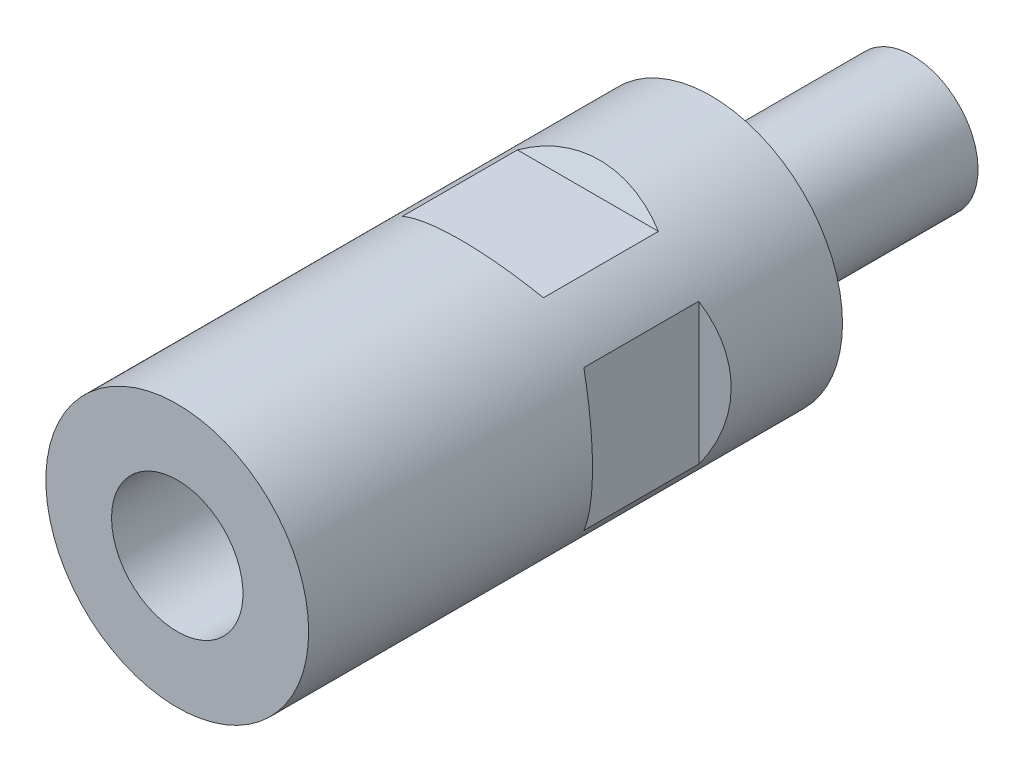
ISO-10303-21;
HEADER;
FILE_DESCRIPTION(('STEP AP214'),'2;1');
FILE_NAME('part.step','',(''),(''),'','','');
FILE_SCHEMA(('AUTOMOTIVE_DESIGN { 1 0 10303 214 1 1 1 1 }'));
ENDSEC;
DATA;
#1=APPLICATION_CONTEXT('core data for automotive mechanical design processes');
#2=APPLICATION_PROTOCOL_DEFINITION('international standard','automotive_design',2000,#1);
#3=PRODUCT_CONTEXT('',#1,'mechanical');
#4=PRODUCT('Part','Part','',(#3));
#5=PRODUCT_RELATED_PRODUCT_CATEGORY('part','',(#4));
#6=PRODUCT_DEFINITION_FORMATION('','',#4);
#7=PRODUCT_DEFINITION_CONTEXT('part definition',#1,'design');
#8=PRODUCT_DEFINITION('design','',#6,#7);
#9=PRODUCT_DEFINITION_SHAPE('','',#8);
#10=(LENGTH_UNIT() NAMED_UNIT(*) SI_UNIT(.MILLI.,.METRE.));
#11=(NAMED_UNIT(*) PLANE_ANGLE_UNIT() SI_UNIT($,.RADIAN.));
#12=(NAMED_UNIT(*) SI_UNIT($,.STERADIAN.) SOLID_ANGLE_UNIT());
#13=UNCERTAINTY_MEASURE_WITH_UNIT(LENGTH_MEASURE(1.E-05),#10,'distance_accuracy_value','');
#14=(GEOMETRIC_REPRESENTATION_CONTEXT(3) GLOBAL_UNCERTAINTY_ASSIGNED_CONTEXT((#13)) GLOBAL_UNIT_ASSIGNED_CONTEXT((#10,
#11,#12)) REPRESENTATION_CONTEXT('',''));
#15=CARTESIAN_POINT('',(0.,0.,0.));
#16=DIRECTION('',(0.,0.,1.));
#17=DIRECTION('',(1.,0.,0.));
#18=AXIS2_PLACEMENT_3D('',#15,#16,#17);
#19=CARTESIAN_POINT('',(0.,0.,-24.5));
#20=DIRECTION('',(0.,0.,1.));
#21=DIRECTION('',(0.,-1.,0.));
#22=AXIS2_PLACEMENT_3D('',#19,#20,#21);
#23=PLANE('',#22);
#24=CARTESIAN_POINT('',(0.,0.,-24.5));
#25=DIRECTION('',(0.,0.,1.));
#26=DIRECTION('',(0.,-1.,0.));
#27=AXIS2_PLACEMENT_3D('',#24,#25,#26);
#28=CIRCLE('',#27,8.);
#29=CARTESIAN_POINT('',(0.,-8.,-24.5));
#30=VERTEX_POINT('',#29);
#31=EDGE_CURVE('E17',#30,#30,#28,.F.);
#32=ORIENTED_EDGE('',*,*,#31,.T.);
#33=EDGE_LOOP('',(#32));
#34=FACE_BOUND('',#33,.T.);
#35=ADVANCED_FACE('F14',(#34),#23,.F.);
#36=CARTESIAN_POINT('',(0.,0.,-4.5));
#37=DIRECTION('',(0.,0.,1.));
#38=DIRECTION('',(0.,-1.,0.));
#39=AXIS2_PLACEMENT_3D('',#36,#37,#38);
#40=CYLINDRICAL_SURFACE('',#39,8.);
#41=CARTESIAN_POINT('',(0.,0.,0.));
#42=DIRECTION('',(0.,0.,-1.));
#43=DIRECTION('',(-1.,0.,0.));
#44=AXIS2_PLACEMENT_3D('',#41,#42,#43);
#45=CIRCLE('',#44,8.);
#46=CARTESIAN_POINT('',(-8.,0.,0.));
#47=VERTEX_POINT('',#46);
#48=EDGE_CURVE('E9',#47,#47,#45,.T.);
#49=ORIENTED_EDGE('',*,*,#48,.T.);
#50=EDGE_LOOP('',(#49));
#51=FACE_BOUND('',#50,.T.);
#52=ORIENTED_EDGE('',*,*,#31,.F.);
#53=EDGE_LOOP('',(#52));
#54=FACE_BOUND('',#53,.T.);
#55=ADVANCED_FACE('F175',(#51,#54),#40,.T.);
#56=CARTESIAN_POINT('',(13.5,-16.,29.));
#57=DIRECTION('',(-0.5,0.,0.86602540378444));
#58=DIRECTION('',(0.86602540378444,0.,0.5));
#59=AXIS2_PLACEMENT_3D('',#56,#57,#58);
#60=PLANE('',#59);
#61=DIRECTION('',(0.,1.,0.));
#62=VECTOR('',#61,1.);
#63=CARTESIAN_POINT('',(13.5,-16.,29.));
#64=LINE('',#63,#62);
#65=CARTESIAN_POINT('',(13.5,-8.58778201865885,29.));
#66=VERTEX_POINT('',#65);
#67=CARTESIAN_POINT('',(13.5,8.58778201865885,29.));
#68=VERTEX_POINT('',#67);
#69=EDGE_CURVE('E139',#66,#68,#64,.T.);
#70=ORIENTED_EDGE('',*,*,#69,.T.);
#71=CARTESIAN_POINT('',(0.,0.,21.2057713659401));
#72=DIRECTION('',(-0.5,0.,0.86602540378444));
#73=DIRECTION('',(-0.86602540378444,0.,-0.5));
#74=AXIS2_PLACEMENT_3D('',#71,#72,#73);
#75=ELLIPSE('',#74,18.475208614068,16.);
#76=EDGE_CURVE('E35',#66,#68,#75,.T.);
#77=ORIENTED_EDGE('',*,*,#76,.F.);
#78=EDGE_LOOP('',(#70,#77));
#79=FACE_BOUND('',#78,.T.);
#80=ADVANCED_FACE('F183',(#79),#60,.F.);
#81=CARTESIAN_POINT('',(13.5,-16.,29.));
#82=DIRECTION('',(-1.,0.,0.));
#83=DIRECTION('',(0.,0.,1.));
#84=AXIS2_PLACEMENT_3D('',#81,#82,#83);
#85=PLANE('',#84);
#86=ORIENTED_EDGE('',*,*,#69,.F.);
#87=DIRECTION('',(0.,0.,-1.));
#88=VECTOR('',#87,1.);
#89=CARTESIAN_POINT('',(13.5,-8.58778201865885,65.));
#90=LINE('',#89,#88);
#91=CARTESIAN_POINT('',(13.5,-8.58778201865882,15.));
#92=VERTEX_POINT('',#91);
#93=EDGE_CURVE('E126',#92,#66,#90,.F.);
#94=ORIENTED_EDGE('',*,*,#93,.F.);
#95=DIRECTION('',(0.,1.,0.));
#96=VECTOR('',#95,1.);
#97=CARTESIAN_POINT('',(13.5,-16.,15.));
#98=LINE('',#97,#96);
#99=CARTESIAN_POINT('',(13.5,8.58778201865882,15.));
#100=VERTEX_POINT('',#99);
#101=EDGE_CURVE('E140',#92,#100,#98,.T.);
#102=ORIENTED_EDGE('',*,*,#101,.T.);
#103=DIRECTION('',(0.,0.,-1.));
#104=VECTOR('',#103,1.);
#105=CARTESIAN_POINT('',(13.5,8.58778201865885,65.));
#106=LINE('',#105,#104);
#107=EDGE_CURVE('E29',#68,#100,#106,.T.);
#108=ORIENTED_EDGE('',*,*,#107,.F.);
#109=EDGE_LOOP('',(#86,#94,#102,#108));
#110=FACE_BOUND('',#109,.T.);
#111=ADVANCED_FACE('F212',(#110),#85,.F.);
#112=CARTESIAN_POINT('',(13.5,-16.,15.));
#113=DIRECTION('',(-0.5,0.,-0.866025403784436));
#114=DIRECTION('',(-0.866025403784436,0.,0.5));
#115=AXIS2_PLACEMENT_3D('',#112,#113,#114);
#116=PLANE('',#115);
#117=CARTESIAN_POINT('',(0.,0.,22.7942286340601));
#118=DIRECTION('',(-0.5,0.,-0.866025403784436));
#119=DIRECTION('',(0.866025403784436,0.,-0.5));
#120=AXIS2_PLACEMENT_3D('',#117,#118,#119);
#121=ELLIPSE('',#120,18.4752086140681,16.);
#122=EDGE_CURVE('E131',#100,#92,#121,.T.);
#123=ORIENTED_EDGE('',*,*,#122,.F.);
#124=ORIENTED_EDGE('',*,*,#101,.F.);
#125=EDGE_LOOP('',(#123,#124));
#126=FACE_BOUND('',#125,.T.);
#127=ADVANCED_FACE('F220',(#126),#116,.F.);
#128=CARTESIAN_POINT('',(-13.5,-16.,15.));
#129=DIRECTION('',(0.5,0.,-0.866025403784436));
#130=DIRECTION('',(-0.866025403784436,0.,-0.5));
#131=AXIS2_PLACEMENT_3D('',#128,#129,#130);
#132=PLANE('',#131);
#133=CARTESIAN_POINT('',(0.,0.,22.7942286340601));
#134=DIRECTION('',(0.5,0.,-0.866025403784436));
#135=DIRECTION('',(-0.866025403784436,0.,-0.5));
#136=AXIS2_PLACEMENT_3D('',#133,#134,#135);
#137=ELLIPSE('',#136,18.4752086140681,16.);
#138=CARTESIAN_POINT('',(-13.5,-8.58778201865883,15.));
#139=VERTEX_POINT('',#138);
#140=CARTESIAN_POINT('',(-13.5,8.58778201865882,15.));
#141=VERTEX_POINT('',#140);
#142=EDGE_CURVE('E124',#139,#141,#137,.T.);
#143=ORIENTED_EDGE('',*,*,#142,.F.);
#144=DIRECTION('',(0.,1.,0.));
#145=VECTOR('',#144,1.);
#146=CARTESIAN_POINT('',(-13.5,-16.,15.));
#147=LINE('',#146,#145);
#148=EDGE_CURVE('E144',#139,#141,#147,.T.);
#149=ORIENTED_EDGE('',*,*,#148,.T.);
#150=EDGE_LOOP('',(#143,#149));
#151=FACE_BOUND('',#150,.T.);
#152=ADVANCED_FACE('F228',(#151),#132,.F.);
#153=CARTESIAN_POINT('',(-13.5,-16.,29.));
#154=DIRECTION('',(0.5,0.,0.86602540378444));
#155=DIRECTION('',(0.86602540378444,0.,-0.5));
#156=AXIS2_PLACEMENT_3D('',#153,#154,#155);
#157=PLANE('',#156);
#158=DIRECTION('',(0.,1.,0.));
#159=VECTOR('',#158,1.);
#160=CARTESIAN_POINT('',(-13.5,-16.,29.));
#161=LINE('',#160,#159);
#162=CARTESIAN_POINT('',(-13.5,-8.58778201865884,29.));
#163=VERTEX_POINT('',#162);
#164=CARTESIAN_POINT('',(-13.5,8.58778201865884,29.));
#165=VERTEX_POINT('',#164);
#166=EDGE_CURVE('E142',#163,#165,#161,.T.);
#167=ORIENTED_EDGE('',*,*,#166,.F.);
#168=CARTESIAN_POINT('',(0.,0.,21.2057713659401));
#169=DIRECTION('',(0.5,0.,0.86602540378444));
#170=DIRECTION('',(0.86602540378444,0.,-0.5));
#171=AXIS2_PLACEMENT_3D('',#168,#169,#170);
#172=ELLIPSE('',#171,18.475208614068,16.);
#173=EDGE_CURVE('E115',#165,#163,#172,.T.);
#174=ORIENTED_EDGE('',*,*,#173,.F.);
#175=EDGE_LOOP('',(#167,#174));
#176=FACE_BOUND('',#175,.T.);
#177=ADVANCED_FACE('F238',(#176),#157,.F.);
#178=CARTESIAN_POINT('',(-13.5,-16.,29.));
#179=DIRECTION('',(1.,0.,0.));
#180=DIRECTION('',(0.,0.,-1.));
#181=AXIS2_PLACEMENT_3D('',#178,#179,#180);
#182=PLANE('',#181);
#183=ORIENTED_EDGE('',*,*,#166,.T.);
#184=DIRECTION('',(0.,0.,-1.));
#185=VECTOR('',#184,1.);
#186=CARTESIAN_POINT('',(-13.5,8.58778201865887,65.));
#187=LINE('',#186,#185);
#188=EDGE_CURVE('E121',#141,#165,#187,.F.);
#189=ORIENTED_EDGE('',*,*,#188,.F.);
#190=ORIENTED_EDGE('',*,*,#148,.F.);
#191=DIRECTION('',(0.,0.,-1.));
#192=VECTOR('',#191,1.);
#193=CARTESIAN_POINT('',(-13.5,-8.58778201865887,65.));
#194=LINE('',#193,#192);
#195=EDGE_CURVE('E118',#163,#139,#194,.T.);
#196=ORIENTED_EDGE('',*,*,#195,.F.);
#197=EDGE_LOOP('',(#183,#189,#190,#196));
#198=FACE_BOUND('',#197,.T.);
#199=ADVANCED_FACE('F231',(#198),#182,.F.);
#200=CARTESIAN_POINT('',(16.,13.5,29.));
#201=DIRECTION('',(0.,-0.5,0.86602540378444));
#202=DIRECTION('',(0.,-0.86602540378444,-0.5));
#203=AXIS2_PLACEMENT_3D('',#200,#201,#202);
#204=PLANE('',#203);
#205=DIRECTION('',(-1.,0.,0.));
#206=VECTOR('',#205,1.);
#207=CARTESIAN_POINT('',(16.,13.5,29.));
#208=LINE('',#207,#206);
#209=CARTESIAN_POINT('',(8.5877820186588,13.5,29.));
#210=VERTEX_POINT('',#209);
#211=CARTESIAN_POINT('',(-8.58778201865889,13.5,29.));
#212=VERTEX_POINT('',#211);
#213=EDGE_CURVE('E147',#210,#212,#208,.T.);
#214=ORIENTED_EDGE('',*,*,#213,.T.);
#215=CARTESIAN_POINT('',(0.,0.,21.2057713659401));
#216=DIRECTION('',(0.,-0.5,0.86602540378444));
#217=DIRECTION('',(0.,-0.86602540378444,-0.5));
#218=AXIS2_PLACEMENT_3D('',#215,#216,#217);
#219=ELLIPSE('',#218,18.475208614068,16.);
#220=EDGE_CURVE('E107',#210,#212,#219,.T.);
#221=ORIENTED_EDGE('',*,*,#220,.F.);
#222=EDGE_LOOP('',(#214,#221));
#223=FACE_BOUND('',#222,.T.);
#224=ADVANCED_FACE('F241',(#223),#204,.F.);
#225=CARTESIAN_POINT('',(16.,13.5,29.));
#226=DIRECTION('',(0.,-1.,0.));
#227=DIRECTION('',(1.,0.,0.));
#228=AXIS2_PLACEMENT_3D('',#225,#226,#227);
#229=PLANE('',#228);
#230=ORIENTED_EDGE('',*,*,#213,.F.);
#231=DIRECTION('',(0.,0.,-1.));
#232=VECTOR('',#231,1.);
#233=CARTESIAN_POINT('',(8.5877820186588,13.5,65.));
#234=LINE('',#233,#232);
#235=CARTESIAN_POINT('',(8.58778201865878,13.5,15.));
#236=VERTEX_POINT('',#235);
#237=EDGE_CURVE('E88',#236,#210,#234,.F.);
#238=ORIENTED_EDGE('',*,*,#237,.F.);
#239=DIRECTION('',(-1.,0.,0.));
#240=VECTOR('',#239,1.);
#241=CARTESIAN_POINT('',(16.,13.5,15.));
#242=LINE('',#241,#240);
#243=CARTESIAN_POINT('',(-8.58778201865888,13.5,15.));
#244=VERTEX_POINT('',#243);
#245=EDGE_CURVE('E150',#236,#244,#242,.T.);
#246=ORIENTED_EDGE('',*,*,#245,.T.);
#247=DIRECTION('',(0.,0.,-1.));
#248=VECTOR('',#247,1.);
#249=CARTESIAN_POINT('',(-8.58778201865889,13.5,65.));
#250=LINE('',#249,#248);
#251=EDGE_CURVE('E110',#212,#244,#250,.T.);
#252=ORIENTED_EDGE('',*,*,#251,.F.);
#253=EDGE_LOOP('',(#230,#238,#246,#252));
#254=FACE_BOUND('',#253,.T.);
#255=ADVANCED_FACE('F264',(#254),#229,.F.);
#256=CARTESIAN_POINT('',(16.,13.5,15.));
#257=DIRECTION('',(0.,-0.5,-0.866025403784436));
#258=DIRECTION('',(0.,0.866025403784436,-0.5));
#259=AXIS2_PLACEMENT_3D('',#256,#257,#258);
#260=PLANE('',#259);
#261=CARTESIAN_POINT('',(0.,0.,22.7942286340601));
#262=DIRECTION('',(0.,-0.5,-0.866025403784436));
#263=DIRECTION('',(0.,0.866025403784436,-0.5));
#264=AXIS2_PLACEMENT_3D('',#261,#262,#263);
#265=ELLIPSE('',#264,18.4752086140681,16.);
#266=EDGE_CURVE('E113',#244,#236,#265,.T.);
#267=ORIENTED_EDGE('',*,*,#266,.F.);
#268=ORIENTED_EDGE('',*,*,#245,.F.);
#269=EDGE_LOOP('',(#267,#268));
#270=FACE_BOUND('',#269,.T.);
#271=ADVANCED_FACE('F273',(#270),#260,.F.);
#272=CARTESIAN_POINT('',(16.,-13.5,15.));
#273=DIRECTION('',(0.,0.5,-0.866025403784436));
#274=DIRECTION('',(0.,0.866025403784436,0.5));
#275=AXIS2_PLACEMENT_3D('',#272,#273,#274);
#276=PLANE('',#275);
#277=CARTESIAN_POINT('',(0.,0.,22.7942286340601));
#278=DIRECTION('',(0.,0.5,-0.866025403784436));
#279=DIRECTION('',(0.,-0.866025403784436,-0.5));
#280=AXIS2_PLACEMENT_3D('',#277,#278,#279);
#281=ELLIPSE('',#280,18.4752086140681,16.);
#282=CARTESIAN_POINT('',(8.58778201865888,-13.5,15.));
#283=VERTEX_POINT('',#282);
#284=CARTESIAN_POINT('',(-8.58778201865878,-13.5,15.));
#285=VERTEX_POINT('',#284);
#286=EDGE_CURVE('E79',#283,#285,#281,.T.);
#287=ORIENTED_EDGE('',*,*,#286,.F.);
#288=DIRECTION('',(-1.,0.,0.));
#289=VECTOR('',#288,1.);
#290=CARTESIAN_POINT('',(16.,-13.5,15.));
#291=LINE('',#290,#289);
#292=EDGE_CURVE('E82',#283,#285,#291,.T.);
#293=ORIENTED_EDGE('',*,*,#292,.T.);
#294=EDGE_LOOP('',(#287,#293));
#295=FACE_BOUND('',#294,.T.);
#296=ADVANCED_FACE('F81',(#295),#276,.F.);
#297=CARTESIAN_POINT('',(16.,-13.5,29.));
#298=DIRECTION('',(0.,0.5,0.86602540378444));
#299=DIRECTION('',(0.,-0.86602540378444,0.5));
#300=AXIS2_PLACEMENT_3D('',#297,#298,#299);
#301=PLANE('',#300);
#302=DIRECTION('',(-1.,0.,0.));
#303=VECTOR('',#302,1.);
#304=CARTESIAN_POINT('',(16.,-13.5,29.));
#305=LINE('',#304,#303);
#306=CARTESIAN_POINT('',(8.58778201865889,-13.5,29.));
#307=VERTEX_POINT('',#306);
#308=CARTESIAN_POINT('',(-8.58778201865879,-13.5,29.));
#309=VERTEX_POINT('',#308);
#310=EDGE_CURVE('E95',#307,#309,#305,.T.);
#311=ORIENTED_EDGE('',*,*,#310,.F.);
#312=CARTESIAN_POINT('',(0.,0.,21.2057713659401));
#313=DIRECTION('',(0.,0.5,0.86602540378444));
#314=DIRECTION('',(0.,0.86602540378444,-0.5));
#315=AXIS2_PLACEMENT_3D('',#312,#313,#314);
#316=ELLIPSE('',#315,18.475208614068,16.);
#317=EDGE_CURVE('E101',#309,#307,#316,.T.);
#318=ORIENTED_EDGE('',*,*,#317,.F.);
#319=EDGE_LOOP('',(#311,#318));
#320=FACE_BOUND('',#319,.T.);
#321=ADVANCED_FACE('F290',(#320),#301,.F.);
#322=CARTESIAN_POINT('',(16.,-13.5,29.));
#323=DIRECTION('',(0.,1.,0.));
#324=DIRECTION('',(-1.,0.,0.));
#325=AXIS2_PLACEMENT_3D('',#322,#323,#324);
#326=PLANE('',#325);
#327=ORIENTED_EDGE('',*,*,#310,.T.);
#328=DIRECTION('',(0.,0.,-1.));
#329=VECTOR('',#328,1.);
#330=CARTESIAN_POINT('',(-8.58778201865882,-13.5,65.));
#331=LINE('',#330,#329);
#332=EDGE_CURVE('E87',#285,#309,#331,.F.);
#333=ORIENTED_EDGE('',*,*,#332,.F.);
#334=ORIENTED_EDGE('',*,*,#292,.F.);
#335=DIRECTION('',(0.,0.,-1.));
#336=VECTOR('',#335,1.);
#337=CARTESIAN_POINT('',(8.58778201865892,-13.5,65.));
#338=LINE('',#337,#336);
#339=EDGE_CURVE('E93',#307,#283,#338,.T.);
#340=ORIENTED_EDGE('',*,*,#339,.F.);
#341=EDGE_LOOP('',(#327,#333,#334,#340));
#342=FACE_BOUND('',#341,.T.);
#343=ADVANCED_FACE('F92',(#342),#326,.F.);
#344=CARTESIAN_POINT('',(0.,0.,65.));
#345=DIRECTION('',(0.,0.,-1.));
#346=DIRECTION('',(-1.,0.,0.));
#347=AXIS2_PLACEMENT_3D('',#344,#345,#346);
#348=CYLINDRICAL_SURFACE('',#347,16.);
#349=ORIENTED_EDGE('',*,*,#332,.T.);
#350=ORIENTED_EDGE('',*,*,#317,.T.);
#351=ORIENTED_EDGE('',*,*,#339,.T.);
#352=ORIENTED_EDGE('',*,*,#286,.T.);
#353=EDGE_LOOP('',(#349,#350,#351,#352));
#354=FACE_BOUND('',#353,.T.);
#355=ORIENTED_EDGE('',*,*,#266,.T.);
#356=ORIENTED_EDGE('',*,*,#237,.T.);
#357=ORIENTED_EDGE('',*,*,#220,.T.);
#358=ORIENTED_EDGE('',*,*,#251,.T.);
#359=EDGE_LOOP('',(#355,#356,#357,#358));
#360=FACE_BOUND('',#359,.T.);
#361=ORIENTED_EDGE('',*,*,#188,.T.);
#362=ORIENTED_EDGE('',*,*,#173,.T.);
#363=ORIENTED_EDGE('',*,*,#195,.T.);
#364=ORIENTED_EDGE('',*,*,#142,.T.);
#365=EDGE_LOOP('',(#361,#362,#363,#364));
#366=FACE_BOUND('',#365,.T.);
#367=ORIENTED_EDGE('',*,*,#122,.T.);
#368=ORIENTED_EDGE('',*,*,#93,.T.);
#369=ORIENTED_EDGE('',*,*,#76,.T.);
#370=ORIENTED_EDGE('',*,*,#107,.T.);
#371=EDGE_LOOP('',(#367,#368,#369,#370));
#372=FACE_BOUND('',#371,.T.);
#373=CARTESIAN_POINT('',(0.,0.,65.));
#374=DIRECTION('',(0.,0.,1.));
#375=DIRECTION('',(1.,0.,0.));
#376=AXIS2_PLACEMENT_3D('',#373,#374,#375);
#377=CIRCLE('',#376,16.);
#378=CARTESIAN_POINT('',(16.,0.,65.));
#379=VERTEX_POINT('',#378);
#380=EDGE_CURVE('E133',#379,#379,#377,.T.);
#381=ORIENTED_EDGE('',*,*,#380,.F.);
#382=EDGE_LOOP('',(#381));
#383=FACE_BOUND('',#382,.T.);
#384=CARTESIAN_POINT('',(0.,0.,0.));
#385=DIRECTION('',(0.,0.,1.));
#386=DIRECTION('',(1.,0.,0.));
#387=AXIS2_PLACEMENT_3D('',#384,#385,#386);
#388=CIRCLE('',#387,16.);
#389=CARTESIAN_POINT('',(16.,0.,0.));
#390=VERTEX_POINT('',#389);
#391=EDGE_CURVE('E136',#390,#390,#388,.T.);
#392=ORIENTED_EDGE('',*,*,#391,.T.);
#393=EDGE_LOOP('',(#392));
#394=FACE_BOUND('',#393,.T.);
#395=ADVANCED_FACE('F99',(#354,#360,#366,#372,#383,#394),#348,.T.);
#396=CARTESIAN_POINT('',(0.,0.,0.));
#397=DIRECTION('',(0.,0.,1.));
#398=DIRECTION('',(1.,0.,0.));
#399=AXIS2_PLACEMENT_3D('',#396,#397,#398);
#400=PLANE('',#399);
#401=ORIENTED_EDGE('',*,*,#48,.F.);
#402=EDGE_LOOP('',(#401));
#403=FACE_BOUND('',#402,.T.);
#404=ORIENTED_EDGE('',*,*,#391,.F.);
#405=EDGE_LOOP('',(#404));
#406=FACE_BOUND('',#405,.T.);
#407=ADVANCED_FACE('F172',(#403,#406),#400,.F.);
#408=CARTESIAN_POINT('',(0.,0.,65.));
#409=DIRECTION('',(0.,0.,1.));
#410=DIRECTION('',(1.,0.,0.));
#411=AXIS2_PLACEMENT_3D('',#408,#409,#410);
#412=PLANE('',#411);
#413=ORIENTED_EDGE('',*,*,#380,.T.);
#414=EDGE_LOOP('',(#413));
#415=FACE_BOUND('',#414,.T.);
#416=CARTESIAN_POINT('',(0.,0.,65.));
#417=DIRECTION('',(0.,0.,-1.));
#418=DIRECTION('',(-1.,0.,0.));
#419=AXIS2_PLACEMENT_3D('',#416,#417,#418);
#420=CIRCLE('',#419,8.);
#421=CARTESIAN_POINT('',(-8.,0.,65.));
#422=VERTEX_POINT('',#421);
#423=EDGE_CURVE('E96',#422,#422,#420,.T.);
#424=ORIENTED_EDGE('',*,*,#423,.T.);
#425=EDGE_LOOP('',(#424));
#426=FACE_BOUND('',#425,.T.);
#427=ADVANCED_FACE('F167',(#415,#426),#412,.T.);
#428=CARTESIAN_POINT('',(0.,0.,0.));
#429=DIRECTION('',(0.,0.,-1.));
#430=DIRECTION('',(-1.,0.,0.));
#431=AXIS2_PLACEMENT_3D('',#428,#429,#430);
#432=CYLINDRICAL_SURFACE('',#431,8.);
#433=CARTESIAN_POINT('',(0.,0.,25.));
#434=DIRECTION('',(0.,0.,1.));
#435=DIRECTION('',(1.,0.,0.));
#436=AXIS2_PLACEMENT_3D('',#433,#434,#435);
#437=CIRCLE('',#436,8.);
#438=CARTESIAN_POINT('',(8.,0.,25.));
#439=VERTEX_POINT('',#438);
#440=EDGE_CURVE('E158',#439,#439,#437,.T.);
#441=ORIENTED_EDGE('',*,*,#440,.F.);
#442=EDGE_LOOP('',(#441));
#443=FACE_BOUND('',#442,.T.);
#444=ORIENTED_EDGE('',*,*,#423,.F.);
#445=EDGE_LOOP('',(#444));
#446=FACE_BOUND('',#445,.T.);
#447=ADVANCED_FACE('F164',(#443,#446),#432,.F.);
#448=CARTESIAN_POINT('',(0.,0.,25.));
#449=DIRECTION('',(0.,0.,1.));
#450=DIRECTION('',(1.,0.,0.));
#451=AXIS2_PLACEMENT_3D('',#448,#449,#450);
#452=PLANE('',#451);
#453=ORIENTED_EDGE('',*,*,#440,.T.);
#454=EDGE_LOOP('',(#453));
#455=FACE_BOUND('',#454,.T.);
#456=ADVANCED_FACE('F162',(#455),#452,.T.);
#457=CLOSED_SHELL('',(#35,#55,#80,#111,#127,#152,#177,#199,#224,#255,#271,#296,#321,#343,#395,
#407,#427,#447,#456));
#458=MANIFOLD_SOLID_BREP('B1',#457);
#459=ADVANCED_BREP_SHAPE_REPRESENTATION('',(#18,#458),#14);
#460=SHAPE_DEFINITION_REPRESENTATION(#9,#459);
ENDSEC;
END-ISO-10303-21;
